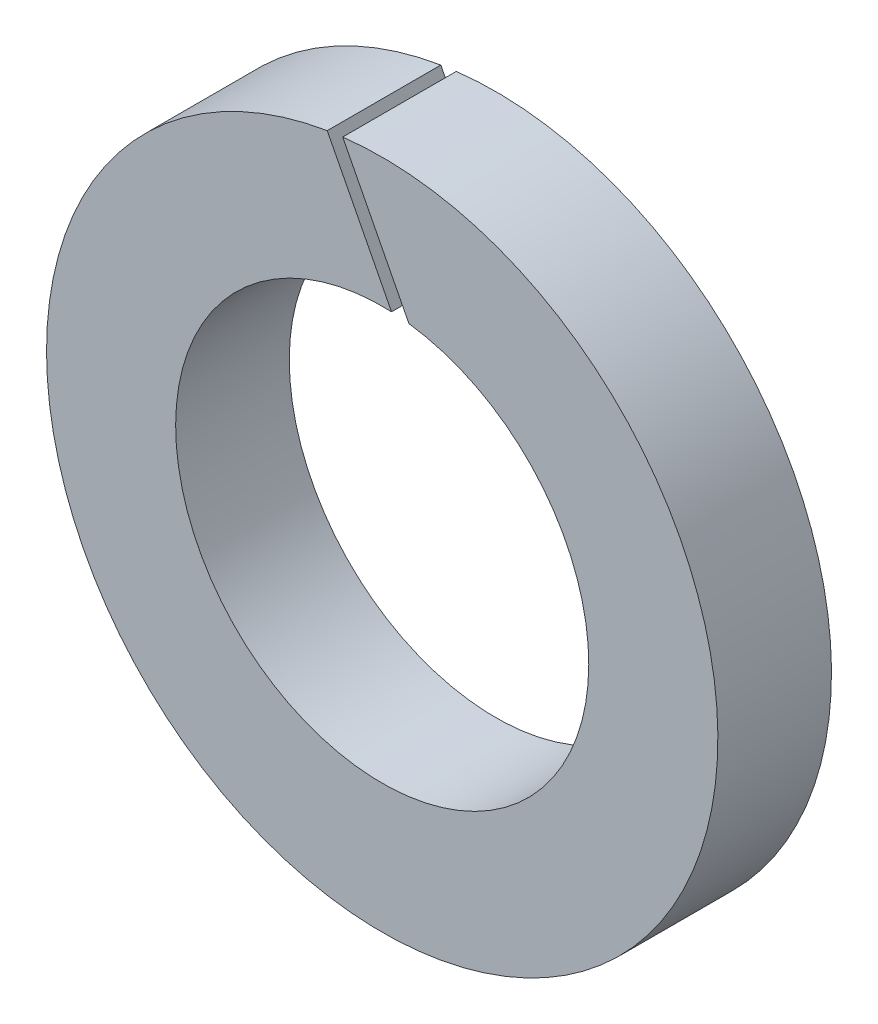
from build123d import *

# Parameters (mm, degrees)
ESQUISSE1_W             = 1.1
ESQUISSE1_H             = 1.25
ENL_V_MAT_EXTRU_1_DEPTH = 5.725991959


with BuildPart() as part:
    # Esquisse1 → R_volution1 (revolve)
    with BuildSketch(Plane(origin=(0, 0, 0), x_dir=(0, 0, -1), z_dir=(1, 0, 0)), mode=Mode.PRIVATE) as r_volution1_sk:
        with Locations((0.55, 2.625)):
            Rectangle(ESQUISSE1_W, ESQUISSE1_H)
    revolve(r_volution1_sk.sketch.rotate(Axis((0, 0, -4.461074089), (0, 0, 1)), 90), axis=Axis((0, 0, -4.461074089), (0, 0, 1)))

    # Esquisse2 → Enl_v. mat.-Extru.1 (cut, through all)
    with BuildSketch(Plane.XY):
        Polygon((-0.601851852, 3.340891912), (0.221088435, 1.744142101), (0.381897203, 1.744142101), (-0.474792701, 3.406376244), align=None)
    extrude(amount=-ENL_V_MAT_EXTRU_1_DEPTH, mode=Mode.SUBTRACT)


solid = part.part
